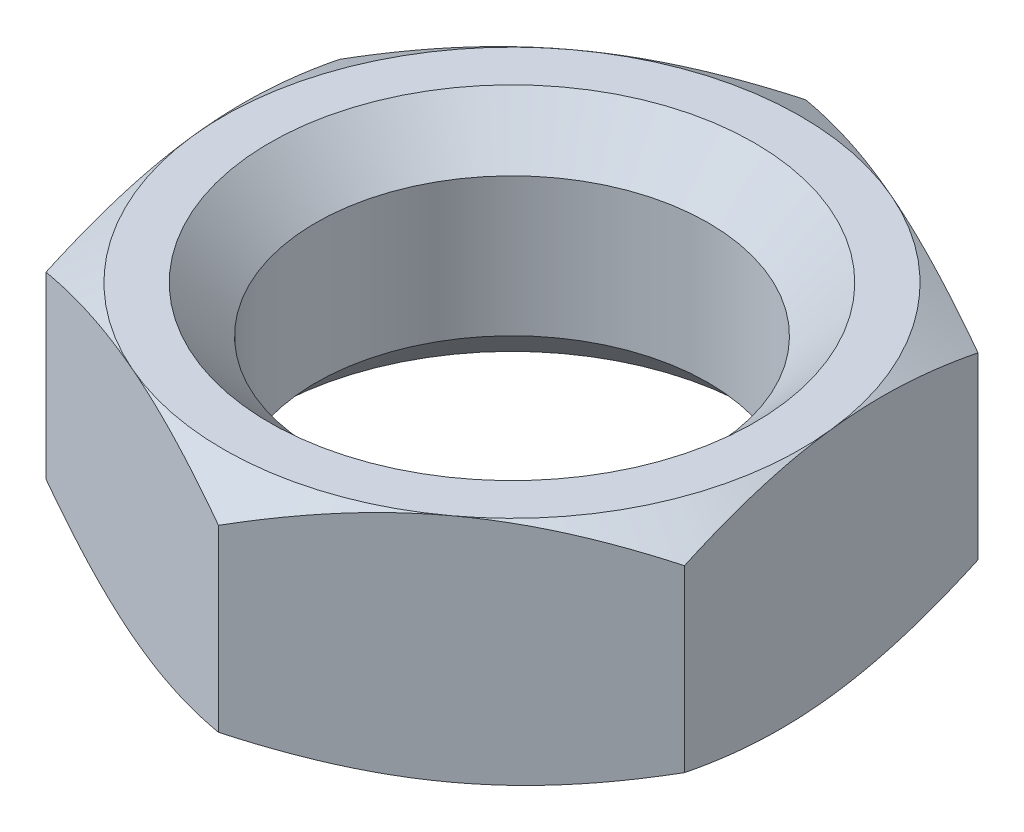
from build123d import *

# Parameters (mm, degrees)
EXTRUDE1_DEPTH         = 4
M8X1_25_TAPPED_HOLE1_D = 6.8
CHAMFER1_SIZE          = 0.8


with BuildPart() as part:
    # Sketch1 → Extrude1 (new body)
    with BuildSketch(Plane(origin=(0, 0, 0), x_dir=(1, 0, 0), z_dir=(0, 1, 0))):
        Polygon((-4.642913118, -3.431718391), (0.650498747, -5.736739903), (5.293411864, -2.305021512), (4.642913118, 3.431718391), (-0.650498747, 5.736739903), (-5.293411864, 2.305021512), align=None)
    extrude(amount=EXTRUDE1_DEPTH)

    # M8x1.25 Tapped Hole1 (through all)
    with Locations(Plane.ZX.offset(4)):
        with Locations((0, 0)):
            Hole(M8X1_25_TAPPED_HOLE1_D / 2)

    # Chamfer1
    chamfer1_edges = [part.edges().sort_by_distance(p)[0] for p in [
        (0, 4, 3.4),
        (0, 0, 3.4),
    ]]
    chamfer(chamfer1_edges, length=CHAMFER1_SIZE)

    # Sketch3 → Cut-Revolve1 (revolve, cut)
    with BuildSketch(Plane(origin=(0, 0, 0), x_dir=(-0.9936324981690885, 0, 0.11266968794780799), z_dir=(-0.11266968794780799, 0, -0.9936324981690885))):
        Polygon((-7, 0), (-7, 1.154700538), (-5, 0), align=None)
        Polygon((-7, 4), (-7, 2.845299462), (-5, 4), align=None)
    revolve(axis=Axis((0, 0, 0), (0, 1, 0)), mode=Mode.SUBTRACT)


solid = part.part
